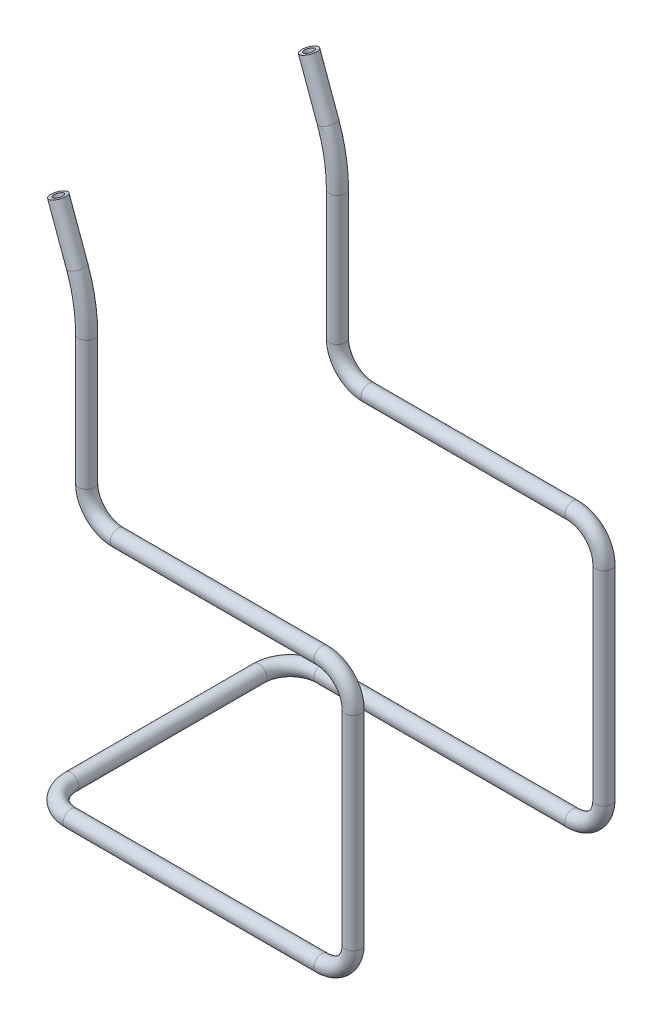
ISO-10303-21;
HEADER;
FILE_DESCRIPTION(('STEP AP214'),'2;1');
FILE_NAME('part.step','',(''),(''),'','','');
FILE_SCHEMA(('AUTOMOTIVE_DESIGN { 1 0 10303 214 1 1 1 1 }'));
ENDSEC;
DATA;
#1=APPLICATION_CONTEXT('core data for automotive mechanical design processes');
#2=APPLICATION_PROTOCOL_DEFINITION('international standard','automotive_design',2000,#1);
#3=PRODUCT_CONTEXT('',#1,'mechanical');
#4=PRODUCT('Part','Part','',(#3));
#5=PRODUCT_RELATED_PRODUCT_CATEGORY('part','',(#4));
#6=PRODUCT_DEFINITION_FORMATION('','',#4);
#7=PRODUCT_DEFINITION_CONTEXT('part definition',#1,'design');
#8=PRODUCT_DEFINITION('design','',#6,#7);
#9=PRODUCT_DEFINITION_SHAPE('','',#8);
#10=(LENGTH_UNIT() NAMED_UNIT(*) SI_UNIT(.MILLI.,.METRE.));
#11=(NAMED_UNIT(*) PLANE_ANGLE_UNIT() SI_UNIT($,.RADIAN.));
#12=(NAMED_UNIT(*) SI_UNIT($,.STERADIAN.) SOLID_ANGLE_UNIT());
#13=UNCERTAINTY_MEASURE_WITH_UNIT(LENGTH_MEASURE(1.E-05),#10,'distance_accuracy_value','');
#14=(GEOMETRIC_REPRESENTATION_CONTEXT(3) GLOBAL_UNCERTAINTY_ASSIGNED_CONTEXT((#13)) GLOBAL_UNIT_ASSIGNED_CONTEXT((#10,
#11,#12)) REPRESENTATION_CONTEXT('',''));
#15=CARTESIAN_POINT('',(0.,0.,0.));
#16=DIRECTION('',(0.,0.,1.));
#17=DIRECTION('',(1.,0.,0.));
#18=AXIS2_PLACEMENT_3D('',#15,#16,#17);
#19=CARTESIAN_POINT('',(5.93646620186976,169.896316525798,40.));
#20=DIRECTION('',(0.342020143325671,-0.939692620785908,0.));
#21=DIRECTION('',(0.939692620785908,0.342020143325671,0.));
#22=AXIS2_PLACEMENT_3D('',#19,#20,#21);
#23=PLANE('',#22);
#24=CARTESIAN_POINT('',(5.93646620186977,169.896316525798,40.));
#25=DIRECTION('',(0.342020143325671,-0.939692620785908,0.));
#26=DIRECTION('',(0.939692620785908,0.342020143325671,0.));
#27=AXIS2_PLACEMENT_3D('',#24,#25,#26);
#28=CIRCLE('',#27,1.5);
#29=CARTESIAN_POINT('',(7.34600513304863,170.409346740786,40.));
#30=VERTEX_POINT('',#29);
#31=EDGE_CURVE('E95',#30,#30,#28,.T.);
#32=ORIENTED_EDGE('',*,*,#31,.T.);
#33=EDGE_LOOP('',(#32));
#34=FACE_BOUND('',#33,.T.);
#35=CARTESIAN_POINT('',(5.93646620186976,169.896316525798,40.));
#36=DIRECTION('',(0.342020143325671,-0.939692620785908,0.));
#37=DIRECTION('',(0.939692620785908,0.342020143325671,0.));
#38=AXIS2_PLACEMENT_3D('',#35,#36,#37);
#39=CIRCLE('',#38,2.5);
#40=CARTESIAN_POINT('',(8.28569775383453,170.751366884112,40.));
#41=VERTEX_POINT('',#40);
#42=EDGE_CURVE('E11',#41,#41,#39,.T.);
#43=ORIENTED_EDGE('',*,*,#42,.F.);
#44=EDGE_LOOP('',(#43));
#45=FACE_BOUND('',#44,.T.);
#46=ADVANCED_FACE('F55',(#34,#45),#23,.F.);
#47=CARTESIAN_POINT('',(0.,0.,0.));
#48=DIRECTION('',(0.,0.,1.));
#49=DIRECTION('',(1.,0.,0.));
#50=AXIS2_PLACEMENT_3D('',#47,#48,#49);
#51=CYLINDRICAL_SURFACE('',#50,2.5);
#52=CARTESIAN_POINT('',(0.,0.,30.));
#53=DIRECTION('',(0.,0.,-1.));
#54=DIRECTION('',(0.,-1.,0.));
#55=AXIS2_PLACEMENT_3D('',#52,#53,#54);
#56=CIRCLE('',#55,2.5);
#57=CARTESIAN_POINT('',(-2.5,0.,30.));
#58=VERTEX_POINT('',#57);
#59=EDGE_CURVE('E92',#58,#58,#56,.T.);
#60=ORIENTED_EDGE('',*,*,#59,.T.);
#61=EDGE_LOOP('',(#60));
#62=FACE_BOUND('',#61,.T.);
#63=CARTESIAN_POINT('',(0.,0.,-30.));
#64=DIRECTION('',(0.,0.,-1.));
#65=DIRECTION('',(0.,-1.,0.));
#66=AXIS2_PLACEMENT_3D('',#63,#64,#65);
#67=CIRCLE('',#66,2.5);
#68=CARTESIAN_POINT('',(-2.5,0.,-30.));
#69=VERTEX_POINT('',#68);
#70=EDGE_CURVE('E158',#69,#69,#67,.F.);
#71=ORIENTED_EDGE('',*,*,#70,.T.);
#72=EDGE_LOOP('',(#71));
#73=FACE_BOUND('',#72,.T.);
#74=ADVANCED_FACE('F305',(#62,#73),#51,.T.);
#75=CARTESIAN_POINT('',(10.,0.,30.));
#76=DIRECTION('',(0.,1.,0.));
#77=DIRECTION('',(0.,0.,1.));
#78=AXIS2_PLACEMENT_3D('',#75,#76,#77);
#79=TOROIDAL_SURFACE('',#78,10.,2.5);
#80=CARTESIAN_POINT('',(10.,0.,40.));
#81=DIRECTION('',(-1.,0.,0.));
#82=DIRECTION('',(0.,-1.,0.));
#83=AXIS2_PLACEMENT_3D('',#80,#81,#82);
#84=CIRCLE('',#83,2.5);
#85=CARTESIAN_POINT('',(10.,0.,42.5));
#86=VERTEX_POINT('',#85);
#87=EDGE_CURVE('E89',#86,#86,#84,.T.);
#88=CARTESIAN_POINT('',(10.,0.,30.));
#89=DIRECTION('',(0.,1.,0.));
#90=DIRECTION('',(0.,0.,1.));
#91=AXIS2_PLACEMENT_3D('',#88,#89,#90);
#92=CIRCLE('',#91,12.5);
#93=EDGE_CURVE('',#58,#86,#92,.T.);
#94=ORIENTED_EDGE('',*,*,#59,.F.);
#95=ORIENTED_EDGE('',*,*,#87,.T.);
#96=ORIENTED_EDGE('',*,*,#93,.T.);
#97=ORIENTED_EDGE('',*,*,#93,.F.);
#98=EDGE_LOOP('',(#94,#96,#95,#97));
#99=FACE_BOUND('',#98,.T.);
#100=ADVANCED_FACE('F307',(#99),#79,.T.);
#101=CARTESIAN_POINT('',(10.,0.,40.));
#102=DIRECTION('',(1.,0.,0.));
#103=DIRECTION('',(0.,0.,-1.));
#104=AXIS2_PLACEMENT_3D('',#101,#102,#103);
#105=CYLINDRICAL_SURFACE('',#104,2.5);
#106=CARTESIAN_POINT('',(90.,0.,40.));
#107=DIRECTION('',(-1.,0.,0.));
#108=DIRECTION('',(0.,-1.,0.));
#109=AXIS2_PLACEMENT_3D('',#106,#107,#108);
#110=CIRCLE('',#109,2.5);
#111=CARTESIAN_POINT('',(90.,-2.5,40.));
#112=VERTEX_POINT('',#111);
#113=EDGE_CURVE('E86',#112,#112,#110,.T.);
#114=ORIENTED_EDGE('',*,*,#113,.T.);
#115=EDGE_LOOP('',(#114));
#116=FACE_BOUND('',#115,.T.);
#117=ORIENTED_EDGE('',*,*,#87,.F.);
#118=EDGE_LOOP('',(#117));
#119=FACE_BOUND('',#118,.T.);
#120=ADVANCED_FACE('F314',(#116,#119),#105,.T.);
#121=CARTESIAN_POINT('',(90.,10.,40.));
#122=DIRECTION('',(0.,0.,1.));
#123=DIRECTION('',(1.,0.,0.));
#124=AXIS2_PLACEMENT_3D('',#121,#122,#123);
#125=TOROIDAL_SURFACE('',#124,10.,2.5);
#126=CARTESIAN_POINT('',(100.,10.,40.));
#127=DIRECTION('',(0.,-1.,0.));
#128=DIRECTION('',(1.,0.,0.));
#129=AXIS2_PLACEMENT_3D('',#126,#127,#128);
#130=CIRCLE('',#129,2.5);
#131=CARTESIAN_POINT('',(102.5,10.,40.));
#132=VERTEX_POINT('',#131);
#133=EDGE_CURVE('E83',#132,#132,#130,.T.);
#134=CARTESIAN_POINT('',(90.,10.,40.));
#135=DIRECTION('',(0.,0.,1.));
#136=DIRECTION('',(1.,0.,0.));
#137=AXIS2_PLACEMENT_3D('',#134,#135,#136);
#138=CIRCLE('',#137,12.5);
#139=EDGE_CURVE('',#112,#132,#138,.T.);
#140=ORIENTED_EDGE('',*,*,#113,.F.);
#141=ORIENTED_EDGE('',*,*,#133,.T.);
#142=ORIENTED_EDGE('',*,*,#139,.T.);
#143=ORIENTED_EDGE('',*,*,#139,.F.);
#144=EDGE_LOOP('',(#140,#142,#141,#143));
#145=FACE_BOUND('',#144,.T.);
#146=ADVANCED_FACE('F322',(#145),#125,.T.);
#147=CARTESIAN_POINT('',(100.,10.,40.));
#148=DIRECTION('',(0.,1.,0.));
#149=DIRECTION('',(0.,0.,1.));
#150=AXIS2_PLACEMENT_3D('',#147,#148,#149);
#151=CYLINDRICAL_SURFACE('',#150,2.5);
#152=CARTESIAN_POINT('',(100.,75.,40.));
#153=DIRECTION('',(0.,-1.,0.));
#154=DIRECTION('',(1.,0.,0.));
#155=AXIS2_PLACEMENT_3D('',#152,#153,#154);
#156=CIRCLE('',#155,2.5);
#157=CARTESIAN_POINT('',(102.5,75.,40.));
#158=VERTEX_POINT('',#157);
#159=EDGE_CURVE('E80',#158,#158,#156,.T.);
#160=ORIENTED_EDGE('',*,*,#159,.T.);
#161=EDGE_LOOP('',(#160));
#162=FACE_BOUND('',#161,.T.);
#163=ORIENTED_EDGE('',*,*,#133,.F.);
#164=EDGE_LOOP('',(#163));
#165=FACE_BOUND('',#164,.T.);
#166=ADVANCED_FACE('F326',(#162,#165),#151,.T.);
#167=CARTESIAN_POINT('',(90.,75.,40.));
#168=DIRECTION('',(0.,0.,1.));
#169=DIRECTION('',(1.,0.,0.));
#170=AXIS2_PLACEMENT_3D('',#167,#168,#169);
#171=TOROIDAL_SURFACE('',#170,9.99999999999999,2.5);
#172=CARTESIAN_POINT('',(90.,85.,40.));
#173=DIRECTION('',(1.,0.,0.));
#174=DIRECTION('',(0.,1.,0.));
#175=AXIS2_PLACEMENT_3D('',#172,#173,#174);
#176=CIRCLE('',#175,2.5);
#177=CARTESIAN_POINT('',(90.,87.5,40.));
#178=VERTEX_POINT('',#177);
#179=EDGE_CURVE('E77',#178,#178,#176,.T.);
#180=CARTESIAN_POINT('',(90.,75.,40.));
#181=DIRECTION('',(0.,0.,1.));
#182=DIRECTION('',(1.,0.,0.));
#183=AXIS2_PLACEMENT_3D('',#180,#181,#182);
#184=CIRCLE('',#183,12.5);
#185=EDGE_CURVE('',#158,#178,#184,.T.);
#186=ORIENTED_EDGE('',*,*,#159,.F.);
#187=ORIENTED_EDGE('',*,*,#179,.T.);
#188=ORIENTED_EDGE('',*,*,#185,.T.);
#189=ORIENTED_EDGE('',*,*,#185,.F.);
#190=EDGE_LOOP('',(#186,#188,#187,#189));
#191=FACE_BOUND('',#190,.T.);
#192=ADVANCED_FACE('F330',(#191),#171,.T.);
#193=CARTESIAN_POINT('',(90.,85.,40.));
#194=DIRECTION('',(-1.,0.,0.));
#195=DIRECTION('',(0.,0.,1.));
#196=AXIS2_PLACEMENT_3D('',#193,#194,#195);
#197=CYLINDRICAL_SURFACE('',#196,2.5);
#198=CARTESIAN_POINT('',(25.,85.,40.));
#199=DIRECTION('',(1.,0.,0.));
#200=DIRECTION('',(0.,1.,0.));
#201=AXIS2_PLACEMENT_3D('',#198,#199,#200);
#202=CIRCLE('',#201,2.5);
#203=CARTESIAN_POINT('',(25.,82.5,40.));
#204=VERTEX_POINT('',#203);
#205=EDGE_CURVE('E74',#204,#204,#202,.T.);
#206=ORIENTED_EDGE('',*,*,#205,.T.);
#207=EDGE_LOOP('',(#206));
#208=FACE_BOUND('',#207,.T.);
#209=ORIENTED_EDGE('',*,*,#179,.F.);
#210=EDGE_LOOP('',(#209));
#211=FACE_BOUND('',#210,.T.);
#212=ADVANCED_FACE('F334',(#208,#211),#197,.T.);
#213=CARTESIAN_POINT('',(25.,95.,40.));
#214=DIRECTION('',(0.,0.,-1.));
#215=DIRECTION('',(-1.,0.,0.));
#216=AXIS2_PLACEMENT_3D('',#213,#214,#215);
#217=TOROIDAL_SURFACE('',#216,9.99999999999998,2.5);
#218=CARTESIAN_POINT('',(15.,95.,40.));
#219=DIRECTION('',(0.,-1.,0.));
#220=DIRECTION('',(1.,0.,0.));
#221=AXIS2_PLACEMENT_3D('',#218,#219,#220);
#222=CIRCLE('',#221,2.5);
#223=CARTESIAN_POINT('',(12.5,95.,40.));
#224=VERTEX_POINT('',#223);
#225=EDGE_CURVE('E69',#224,#224,#222,.T.);
#226=CARTESIAN_POINT('',(25.,95.,40.));
#227=DIRECTION('',(0.,0.,-1.));
#228=DIRECTION('',(-1.,0.,0.));
#229=AXIS2_PLACEMENT_3D('',#226,#227,#228);
#230=CIRCLE('',#229,12.5);
#231=EDGE_CURVE('',#204,#224,#230,.T.);
#232=ORIENTED_EDGE('',*,*,#205,.F.);
#233=ORIENTED_EDGE('',*,*,#225,.T.);
#234=ORIENTED_EDGE('',*,*,#231,.T.);
#235=ORIENTED_EDGE('',*,*,#231,.F.);
#236=EDGE_LOOP('',(#232,#234,#233,#235));
#237=FACE_BOUND('',#236,.T.);
#238=ADVANCED_FACE('F338',(#237),#217,.T.);
#239=CARTESIAN_POINT('',(15.,95.,40.));
#240=DIRECTION('',(0.,1.,0.));
#241=DIRECTION('',(-1.,0.,0.));
#242=AXIS2_PLACEMENT_3D('',#239,#240,#241);
#243=CYLINDRICAL_SURFACE('',#242,2.5);
#244=CARTESIAN_POINT('',(15.,136.178113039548,40.));
#245=DIRECTION('',(0.,-1.,0.));
#246=DIRECTION('',(1.,0.,0.));
#247=AXIS2_PLACEMENT_3D('',#244,#245,#246);
#248=CIRCLE('',#247,2.5);
#249=CARTESIAN_POINT('',(17.5,136.178113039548,40.));
#250=VERTEX_POINT('',#249);
#251=EDGE_CURVE('E65',#250,#250,#248,.T.);
#252=ORIENTED_EDGE('',*,*,#251,.T.);
#253=EDGE_LOOP('',(#252));
#254=FACE_BOUND('',#253,.T.);
#255=ORIENTED_EDGE('',*,*,#225,.F.);
#256=EDGE_LOOP('',(#255));
#257=FACE_BOUND('',#256,.T.);
#258=ADVANCED_FACE('F342',(#254,#257),#243,.T.);
#259=CARTESIAN_POINT('',(-35.,136.178113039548,40.));
#260=DIRECTION('',(0.,0.,1.));
#261=DIRECTION('',(1.,0.,0.));
#262=AXIS2_PLACEMENT_3D('',#259,#260,#261);
#263=TOROIDAL_SURFACE('',#262,50.,2.5);
#264=CARTESIAN_POINT('',(11.9846310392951,153.279120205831,40.));
#265=DIRECTION('',(0.342020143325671,-0.939692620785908,0.));
#266=DIRECTION('',(0.939692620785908,0.342020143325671,0.));
#267=AXIS2_PLACEMENT_3D('',#264,#265,#266);
#268=CIRCLE('',#267,2.5);
#269=CARTESIAN_POINT('',(14.3338625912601,154.134170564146,40.));
#270=VERTEX_POINT('',#269);
#271=EDGE_CURVE('E61',#270,#270,#268,.T.);
#272=CARTESIAN_POINT('',(-35.,136.178113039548,40.));
#273=DIRECTION('',(0.,0.,1.));
#274=DIRECTION('',(1.,0.,0.));
#275=AXIS2_PLACEMENT_3D('',#272,#273,#274);
#276=CIRCLE('',#275,52.5);
#277=EDGE_CURVE('',#250,#270,#276,.T.);
#278=ORIENTED_EDGE('',*,*,#251,.F.);
#279=ORIENTED_EDGE('',*,*,#271,.T.);
#280=ORIENTED_EDGE('',*,*,#277,.T.);
#281=ORIENTED_EDGE('',*,*,#277,.F.);
#282=EDGE_LOOP('',(#278,#280,#279,#281));
#283=FACE_BOUND('',#282,.T.);
#284=ADVANCED_FACE('F211',(#283),#263,.T.);
#285=CARTESIAN_POINT('',(11.9846310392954,153.279120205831,40.));
#286=DIRECTION('',(-0.34202014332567,0.939692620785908,0.));
#287=DIRECTION('',(-0.939692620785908,-0.34202014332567,0.));
#288=AXIS2_PLACEMENT_3D('',#285,#286,#287);
#289=CYLINDRICAL_SURFACE('',#288,2.5);
#290=ORIENTED_EDGE('',*,*,#42,.T.);
#291=EDGE_LOOP('',(#290));
#292=FACE_BOUND('',#291,.T.);
#293=ORIENTED_EDGE('',*,*,#271,.F.);
#294=EDGE_LOOP('',(#293));
#295=FACE_BOUND('',#294,.T.);
#296=ADVANCED_FACE('F200',(#292,#295),#289,.T.);
#297=CARTESIAN_POINT('',(0.,0.,0.));
#298=DIRECTION('',(0.,0.,1.));
#299=DIRECTION('',(1.,0.,0.));
#300=AXIS2_PLACEMENT_3D('',#297,#298,#299);
#301=CYLINDRICAL_SURFACE('',#300,1.5);
#302=CARTESIAN_POINT('',(0.,0.,30.));
#303=DIRECTION('',(0.,0.,1.));
#304=DIRECTION('',(1.,0.,0.));
#305=AXIS2_PLACEMENT_3D('',#302,#303,#304);
#306=CIRCLE('',#305,1.5);
#307=CARTESIAN_POINT('',(-1.5,0.,30.));
#308=VERTEX_POINT('',#307);
#309=EDGE_CURVE('E125',#308,#308,#306,.F.);
#310=ORIENTED_EDGE('',*,*,#309,.F.);
#311=EDGE_LOOP('',(#310));
#312=FACE_BOUND('',#311,.T.);
#313=CARTESIAN_POINT('',(0.,0.,-30.));
#314=DIRECTION('',(0.,0.,-1.));
#315=DIRECTION('',(-1.,0.,0.));
#316=AXIS2_PLACEMENT_3D('',#313,#314,#315);
#317=CIRCLE('',#316,1.5);
#318=CARTESIAN_POINT('',(-1.5,0.,-30.));
#319=VERTEX_POINT('',#318);
#320=EDGE_CURVE('E191',#319,#319,#317,.F.);
#321=ORIENTED_EDGE('',*,*,#320,.F.);
#322=EDGE_LOOP('',(#321));
#323=FACE_BOUND('',#322,.T.);
#324=ADVANCED_FACE('F197',(#312,#323),#301,.F.);
#325=CARTESIAN_POINT('',(10.,0.,30.));
#326=DIRECTION('',(0.,1.,0.));
#327=DIRECTION('',(0.,0.,1.));
#328=AXIS2_PLACEMENT_3D('',#325,#326,#327);
#329=TOROIDAL_SURFACE('',#328,10.,1.5);
#330=CARTESIAN_POINT('',(10.,0.,40.));
#331=DIRECTION('',(-1.,0.,0.));
#332=DIRECTION('',(0.,0.,1.));
#333=AXIS2_PLACEMENT_3D('',#330,#331,#332);
#334=CIRCLE('',#333,1.5);
#335=CARTESIAN_POINT('',(10.,0.,41.5));
#336=VERTEX_POINT('',#335);
#337=EDGE_CURVE('E122',#336,#336,#334,.T.);
#338=CARTESIAN_POINT('',(10.,0.,30.));
#339=DIRECTION('',(0.,1.,0.));
#340=DIRECTION('',(0.,0.,1.));
#341=AXIS2_PLACEMENT_3D('',#338,#339,#340);
#342=CIRCLE('',#341,11.5);
#343=EDGE_CURVE('',#308,#336,#342,.T.);
#344=ORIENTED_EDGE('',*,*,#309,.T.);
#345=ORIENTED_EDGE('',*,*,#337,.F.);
#346=ORIENTED_EDGE('',*,*,#343,.T.);
#347=ORIENTED_EDGE('',*,*,#343,.F.);
#348=EDGE_LOOP('',(#344,#346,#345,#347));
#349=FACE_BOUND('',#348,.T.);
#350=ADVANCED_FACE('F199',(#349),#329,.F.);
#351=CARTESIAN_POINT('',(10.,0.,40.));
#352=DIRECTION('',(1.,0.,0.));
#353=DIRECTION('',(0.,0.,-1.));
#354=AXIS2_PLACEMENT_3D('',#351,#352,#353);
#355=CYLINDRICAL_SURFACE('',#354,1.5);
#356=CARTESIAN_POINT('',(90.,0.,40.));
#357=DIRECTION('',(1.,0.,0.));
#358=DIRECTION('',(0.,0.,-1.));
#359=AXIS2_PLACEMENT_3D('',#356,#357,#358);
#360=CIRCLE('',#359,1.5);
#361=CARTESIAN_POINT('',(90.,-1.5,40.));
#362=VERTEX_POINT('',#361);
#363=EDGE_CURVE('E119',#362,#362,#360,.F.);
#364=ORIENTED_EDGE('',*,*,#363,.F.);
#365=EDGE_LOOP('',(#364));
#366=FACE_BOUND('',#365,.T.);
#367=ORIENTED_EDGE('',*,*,#337,.T.);
#368=EDGE_LOOP('',(#367));
#369=FACE_BOUND('',#368,.T.);
#370=ADVANCED_FACE('F208',(#366,#369),#355,.F.);
#371=CARTESIAN_POINT('',(90.,10.,40.));
#372=DIRECTION('',(0.,0.,1.));
#373=DIRECTION('',(1.,0.,0.));
#374=AXIS2_PLACEMENT_3D('',#371,#372,#373);
#375=TOROIDAL_SURFACE('',#374,10.,1.5);
#376=CARTESIAN_POINT('',(100.,10.,40.));
#377=DIRECTION('',(0.,-1.,0.));
#378=DIRECTION('',(1.,0.,0.));
#379=AXIS2_PLACEMENT_3D('',#376,#377,#378);
#380=CIRCLE('',#379,1.5);
#381=CARTESIAN_POINT('',(101.5,10.0000000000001,40.));
#382=VERTEX_POINT('',#381);
#383=EDGE_CURVE('E116',#382,#382,#380,.T.);
#384=CARTESIAN_POINT('',(90.,10.,40.));
#385=DIRECTION('',(0.,0.,1.));
#386=DIRECTION('',(1.,0.,0.));
#387=AXIS2_PLACEMENT_3D('',#384,#385,#386);
#388=CIRCLE('',#387,11.5);
#389=EDGE_CURVE('',#362,#382,#388,.T.);
#390=ORIENTED_EDGE('',*,*,#363,.T.);
#391=ORIENTED_EDGE('',*,*,#383,.F.);
#392=ORIENTED_EDGE('',*,*,#389,.T.);
#393=ORIENTED_EDGE('',*,*,#389,.F.);
#394=EDGE_LOOP('',(#390,#392,#391,#393));
#395=FACE_BOUND('',#394,.T.);
#396=ADVANCED_FACE('F390',(#395),#375,.F.);
#397=CARTESIAN_POINT('',(100.,10.,40.));
#398=DIRECTION('',(0.,1.,0.));
#399=DIRECTION('',(0.,0.,1.));
#400=AXIS2_PLACEMENT_3D('',#397,#398,#399);
#401=CYLINDRICAL_SURFACE('',#400,1.5);
#402=CARTESIAN_POINT('',(100.,75.,40.));
#403=DIRECTION('',(0.,1.,0.));
#404=DIRECTION('',(0.,0.,1.));
#405=AXIS2_PLACEMENT_3D('',#402,#403,#404);
#406=CIRCLE('',#405,1.5);
#407=CARTESIAN_POINT('',(101.5,75.,40.));
#408=VERTEX_POINT('',#407);
#409=EDGE_CURVE('E113',#408,#408,#406,.F.);
#410=ORIENTED_EDGE('',*,*,#409,.F.);
#411=EDGE_LOOP('',(#410));
#412=FACE_BOUND('',#411,.T.);
#413=ORIENTED_EDGE('',*,*,#383,.T.);
#414=EDGE_LOOP('',(#413));
#415=FACE_BOUND('',#414,.T.);
#416=ADVANCED_FACE('F400',(#412,#415),#401,.F.);
#417=CARTESIAN_POINT('',(90.,75.,40.));
#418=DIRECTION('',(0.,0.,1.));
#419=DIRECTION('',(1.,0.,0.));
#420=AXIS2_PLACEMENT_3D('',#417,#418,#419);
#421=TOROIDAL_SURFACE('',#420,9.99999999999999,1.5);
#422=CARTESIAN_POINT('',(90.,85.,40.));
#423=DIRECTION('',(1.,0.,0.));
#424=DIRECTION('',(0.,1.,0.));
#425=AXIS2_PLACEMENT_3D('',#422,#423,#424);
#426=CIRCLE('',#425,1.5);
#427=CARTESIAN_POINT('',(90.,86.5,40.));
#428=VERTEX_POINT('',#427);
#429=EDGE_CURVE('E110',#428,#428,#426,.T.);
#430=CARTESIAN_POINT('',(90.,75.,40.));
#431=DIRECTION('',(0.,0.,1.));
#432=DIRECTION('',(1.,0.,0.));
#433=AXIS2_PLACEMENT_3D('',#430,#431,#432);
#434=CIRCLE('',#433,11.5);
#435=EDGE_CURVE('',#408,#428,#434,.T.);
#436=ORIENTED_EDGE('',*,*,#409,.T.);
#437=ORIENTED_EDGE('',*,*,#429,.F.);
#438=ORIENTED_EDGE('',*,*,#435,.T.);
#439=ORIENTED_EDGE('',*,*,#435,.F.);
#440=EDGE_LOOP('',(#436,#438,#437,#439));
#441=FACE_BOUND('',#440,.T.);
#442=ADVANCED_FACE('F410',(#441),#421,.F.);
#443=CARTESIAN_POINT('',(90.,85.,40.));
#444=DIRECTION('',(-1.,0.,0.));
#445=DIRECTION('',(0.,0.,1.));
#446=AXIS2_PLACEMENT_3D('',#443,#444,#445);
#447=CYLINDRICAL_SURFACE('',#446,1.5);
#448=CARTESIAN_POINT('',(25.,85.,40.));
#449=DIRECTION('',(-1.,0.,0.));
#450=DIRECTION('',(0.,0.,1.));
#451=AXIS2_PLACEMENT_3D('',#448,#449,#450);
#452=CIRCLE('',#451,1.5);
#453=CARTESIAN_POINT('',(25.,83.5,40.));
#454=VERTEX_POINT('',#453);
#455=EDGE_CURVE('E107',#454,#454,#452,.F.);
#456=ORIENTED_EDGE('',*,*,#455,.F.);
#457=EDGE_LOOP('',(#456));
#458=FACE_BOUND('',#457,.T.);
#459=ORIENTED_EDGE('',*,*,#429,.T.);
#460=EDGE_LOOP('',(#459));
#461=FACE_BOUND('',#460,.T.);
#462=ADVANCED_FACE('F420',(#458,#461),#447,.F.);
#463=CARTESIAN_POINT('',(25.,95.,40.));
#464=DIRECTION('',(0.,0.,-1.));
#465=DIRECTION('',(-1.,0.,0.));
#466=AXIS2_PLACEMENT_3D('',#463,#464,#465);
#467=TOROIDAL_SURFACE('',#466,9.99999999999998,1.5);
#468=CARTESIAN_POINT('',(15.,95.,40.));
#469=DIRECTION('',(0.,-1.,0.));
#470=DIRECTION('',(1.,0.,0.));
#471=AXIS2_PLACEMENT_3D('',#468,#469,#470);
#472=CIRCLE('',#471,1.5);
#473=CARTESIAN_POINT('',(13.5,95.,40.));
#474=VERTEX_POINT('',#473);
#475=EDGE_CURVE('E104',#474,#474,#472,.T.);
#476=CARTESIAN_POINT('',(25.,95.,40.));
#477=DIRECTION('',(0.,0.,-1.));
#478=DIRECTION('',(-1.,0.,0.));
#479=AXIS2_PLACEMENT_3D('',#476,#477,#478);
#480=CIRCLE('',#479,11.5);
#481=EDGE_CURVE('',#454,#474,#480,.T.);
#482=ORIENTED_EDGE('',*,*,#455,.T.);
#483=ORIENTED_EDGE('',*,*,#475,.F.);
#484=ORIENTED_EDGE('',*,*,#481,.T.);
#485=ORIENTED_EDGE('',*,*,#481,.F.);
#486=EDGE_LOOP('',(#482,#484,#483,#485));
#487=FACE_BOUND('',#486,.T.);
#488=ADVANCED_FACE('F430',(#487),#467,.F.);
#489=CARTESIAN_POINT('',(15.,95.,40.));
#490=DIRECTION('',(0.,1.,0.));
#491=DIRECTION('',(-1.,0.,0.));
#492=AXIS2_PLACEMENT_3D('',#489,#490,#491);
#493=CYLINDRICAL_SURFACE('',#492,1.5);
#494=CARTESIAN_POINT('',(15.,136.178113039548,40.));
#495=DIRECTION('',(0.,1.,0.));
#496=DIRECTION('',(-1.,0.,0.));
#497=AXIS2_PLACEMENT_3D('',#494,#495,#496);
#498=CIRCLE('',#497,1.5);
#499=CARTESIAN_POINT('',(16.5,136.178113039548,40.));
#500=VERTEX_POINT('',#499);
#501=EDGE_CURVE('E101',#500,#500,#498,.F.);
#502=ORIENTED_EDGE('',*,*,#501,.F.);
#503=EDGE_LOOP('',(#502));
#504=FACE_BOUND('',#503,.T.);
#505=ORIENTED_EDGE('',*,*,#475,.T.);
#506=EDGE_LOOP('',(#505));
#507=FACE_BOUND('',#506,.T.);
#508=ADVANCED_FACE('F440',(#504,#507),#493,.F.);
#509=CARTESIAN_POINT('',(-35.,136.178113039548,40.));
#510=DIRECTION('',(0.,0.,1.));
#511=DIRECTION('',(1.,0.,0.));
#512=AXIS2_PLACEMENT_3D('',#509,#510,#511);
#513=TOROIDAL_SURFACE('',#512,50.,1.5);
#514=CARTESIAN_POINT('',(11.9846310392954,153.279120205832,40.));
#515=DIRECTION('',(0.342020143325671,-0.939692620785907,0.));
#516=DIRECTION('',(0.939692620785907,0.342020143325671,0.));
#517=AXIS2_PLACEMENT_3D('',#514,#515,#516);
#518=CIRCLE('',#517,1.5);
#519=CARTESIAN_POINT('',(13.3941699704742,153.79215042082,40.));
#520=VERTEX_POINT('',#519);
#521=EDGE_CURVE('E98',#520,#520,#518,.T.);
#522=CARTESIAN_POINT('',(-35.,136.178113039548,40.));
#523=DIRECTION('',(0.,0.,1.));
#524=DIRECTION('',(1.,0.,0.));
#525=AXIS2_PLACEMENT_3D('',#522,#523,#524);
#526=CIRCLE('',#525,51.5);
#527=EDGE_CURVE('',#500,#520,#526,.T.);
#528=ORIENTED_EDGE('',*,*,#501,.T.);
#529=ORIENTED_EDGE('',*,*,#521,.F.);
#530=ORIENTED_EDGE('',*,*,#527,.T.);
#531=ORIENTED_EDGE('',*,*,#527,.F.);
#532=EDGE_LOOP('',(#528,#530,#529,#531));
#533=FACE_BOUND('',#532,.T.);
#534=ADVANCED_FACE('F243',(#533),#513,.F.);
#535=CARTESIAN_POINT('',(11.9846310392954,153.279120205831,40.));
#536=DIRECTION('',(-0.34202014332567,0.939692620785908,0.));
#537=DIRECTION('',(-0.939692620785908,-0.34202014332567,0.));
#538=AXIS2_PLACEMENT_3D('',#535,#536,#537);
#539=CYLINDRICAL_SURFACE('',#538,1.5);
#540=ORIENTED_EDGE('',*,*,#31,.F.);
#541=EDGE_LOOP('',(#540));
#542=FACE_BOUND('',#541,.T.);
#543=ORIENTED_EDGE('',*,*,#521,.T.);
#544=EDGE_LOOP('',(#543));
#545=FACE_BOUND('',#544,.T.);
#546=ADVANCED_FACE('F233',(#542,#545),#539,.F.);
#547=CARTESIAN_POINT('',(5.93646620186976,169.896316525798,-40.));
#548=DIRECTION('',(0.342020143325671,-0.939692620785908,0.));
#549=DIRECTION('',(0.939692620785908,0.342020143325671,0.));
#550=AXIS2_PLACEMENT_3D('',#547,#548,#549);
#551=PLANE('',#550);
#552=CARTESIAN_POINT('',(5.93646620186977,169.896316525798,-40.));
#553=DIRECTION('',(0.342020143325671,-0.939692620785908,0.));
#554=DIRECTION('',(0.939692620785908,0.342020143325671,0.));
#555=AXIS2_PLACEMENT_3D('',#552,#553,#554);
#556=CIRCLE('',#555,1.5);
#557=CARTESIAN_POINT('',(7.34600513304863,170.409346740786,-40.));
#558=VERTEX_POINT('',#557);
#559=EDGE_CURVE('E161',#558,#558,#556,.T.);
#560=ORIENTED_EDGE('',*,*,#559,.T.);
#561=EDGE_LOOP('',(#560));
#562=FACE_BOUND('',#561,.T.);
#563=CARTESIAN_POINT('',(5.93646620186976,169.896316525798,-40.));
#564=DIRECTION('',(-0.342020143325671,0.939692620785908,0.));
#565=DIRECTION('',(0.939692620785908,0.342020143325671,0.));
#566=AXIS2_PLACEMENT_3D('',#563,#564,#565);
#567=CIRCLE('',#566,2.5);
#568=CARTESIAN_POINT('',(8.28569775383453,170.751366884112,-40.));
#569=VERTEX_POINT('',#568);
#570=EDGE_CURVE('E128',#569,#569,#567,.F.);
#571=ORIENTED_EDGE('',*,*,#570,.F.);
#572=EDGE_LOOP('',(#571));
#573=FACE_BOUND('',#572,.T.);
#574=ADVANCED_FACE('F230',(#562,#573),#551,.F.);
#575=CARTESIAN_POINT('',(10.,0.,-30.));
#576=DIRECTION('',(0.,-1.,0.));
#577=DIRECTION('',(0.,0.,-1.));
#578=AXIS2_PLACEMENT_3D('',#575,#576,#577);
#579=TOROIDAL_SURFACE('',#578,10.,2.5);
#580=CARTESIAN_POINT('',(10.,0.,-40.));
#581=DIRECTION('',(1.,0.,0.));
#582=DIRECTION('',(0.,-1.,0.));
#583=AXIS2_PLACEMENT_3D('',#580,#581,#582);
#584=CIRCLE('',#583,2.5);
#585=CARTESIAN_POINT('',(10.,0.,-42.5));
#586=VERTEX_POINT('',#585);
#587=EDGE_CURVE('E155',#586,#586,#584,.F.);
#588=CARTESIAN_POINT('',(10.,0.,-30.));
#589=DIRECTION('',(0.,-1.,0.));
#590=DIRECTION('',(0.,0.,-1.));
#591=AXIS2_PLACEMENT_3D('',#588,#589,#590);
#592=CIRCLE('',#591,12.5);
#593=EDGE_CURVE('',#69,#586,#592,.T.);
#594=ORIENTED_EDGE('',*,*,#70,.F.);
#595=ORIENTED_EDGE('',*,*,#587,.T.);
#596=ORIENTED_EDGE('',*,*,#593,.T.);
#597=ORIENTED_EDGE('',*,*,#593,.F.);
#598=EDGE_LOOP('',(#594,#596,#595,#597));
#599=FACE_BOUND('',#598,.T.);
#600=ADVANCED_FACE('F232',(#599),#579,.T.);
#601=CARTESIAN_POINT('',(10.,0.,-40.));
#602=DIRECTION('',(1.,0.,0.));
#603=DIRECTION('',(0.,0.,-1.));
#604=AXIS2_PLACEMENT_3D('',#601,#602,#603);
#605=CYLINDRICAL_SURFACE('',#604,2.5);
#606=CARTESIAN_POINT('',(90.,0.,-40.));
#607=DIRECTION('',(1.,0.,0.));
#608=DIRECTION('',(0.,-1.,0.));
#609=AXIS2_PLACEMENT_3D('',#606,#607,#608);
#610=CIRCLE('',#609,2.5);
#611=CARTESIAN_POINT('',(90.,-2.5,-40.));
#612=VERTEX_POINT('',#611);
#613=EDGE_CURVE('E152',#612,#612,#610,.F.);
#614=ORIENTED_EDGE('',*,*,#613,.T.);
#615=EDGE_LOOP('',(#614));
#616=FACE_BOUND('',#615,.T.);
#617=ORIENTED_EDGE('',*,*,#587,.F.);
#618=EDGE_LOOP('',(#617));
#619=FACE_BOUND('',#618,.T.);
#620=ADVANCED_FACE('F240',(#616,#619),#605,.T.);
#621=CARTESIAN_POINT('',(90.,10.,-40.));
#622=DIRECTION('',(0.,0.,1.));
#623=DIRECTION('',(1.,0.,0.));
#624=AXIS2_PLACEMENT_3D('',#621,#622,#623);
#625=TOROIDAL_SURFACE('',#624,10.,2.5);
#626=CARTESIAN_POINT('',(100.,10.,-40.));
#627=DIRECTION('',(0.,1.,0.));
#628=DIRECTION('',(1.,0.,0.));
#629=AXIS2_PLACEMENT_3D('',#626,#627,#628);
#630=CIRCLE('',#629,2.5);
#631=CARTESIAN_POINT('',(102.5,10.,-40.));
#632=VERTEX_POINT('',#631);
#633=EDGE_CURVE('E149',#632,#632,#630,.F.);
#634=CARTESIAN_POINT('',(90.,10.,-40.));
#635=DIRECTION('',(0.,0.,1.));
#636=DIRECTION('',(1.,0.,0.));
#637=AXIS2_PLACEMENT_3D('',#634,#635,#636);
#638=CIRCLE('',#637,12.5);
#639=EDGE_CURVE('',#612,#632,#638,.T.);
#640=ORIENTED_EDGE('',*,*,#613,.F.);
#641=ORIENTED_EDGE('',*,*,#633,.T.);
#642=ORIENTED_EDGE('',*,*,#639,.T.);
#643=ORIENTED_EDGE('',*,*,#639,.F.);
#644=EDGE_LOOP('',(#640,#642,#641,#643));
#645=FACE_BOUND('',#644,.T.);
#646=ADVANCED_FACE('F263',(#645),#625,.T.);
#647=CARTESIAN_POINT('',(100.,10.,-40.));
#648=DIRECTION('',(0.,1.,0.));
#649=DIRECTION('',(0.,0.,1.));
#650=AXIS2_PLACEMENT_3D('',#647,#648,#649);
#651=CYLINDRICAL_SURFACE('',#650,2.5);
#652=CARTESIAN_POINT('',(100.,75.,-40.));
#653=DIRECTION('',(0.,1.,0.));
#654=DIRECTION('',(1.,0.,0.));
#655=AXIS2_PLACEMENT_3D('',#652,#653,#654);
#656=CIRCLE('',#655,2.5);
#657=CARTESIAN_POINT('',(102.5,75.,-40.));
#658=VERTEX_POINT('',#657);
#659=EDGE_CURVE('E146',#658,#658,#656,.F.);
#660=ORIENTED_EDGE('',*,*,#659,.T.);
#661=EDGE_LOOP('',(#660));
#662=FACE_BOUND('',#661,.T.);
#663=ORIENTED_EDGE('',*,*,#633,.F.);
#664=EDGE_LOOP('',(#663));
#665=FACE_BOUND('',#664,.T.);
#666=ADVANCED_FACE('F267',(#662,#665),#651,.T.);
#667=CARTESIAN_POINT('',(90.,75.,-40.));
#668=DIRECTION('',(0.,0.,1.));
#669=DIRECTION('',(1.,0.,0.));
#670=AXIS2_PLACEMENT_3D('',#667,#668,#669);
#671=TOROIDAL_SURFACE('',#670,9.99999999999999,2.5);
#672=CARTESIAN_POINT('',(90.,85.,-40.));
#673=DIRECTION('',(-1.,0.,0.));
#674=DIRECTION('',(0.,1.,0.));
#675=AXIS2_PLACEMENT_3D('',#672,#673,#674);
#676=CIRCLE('',#675,2.5);
#677=CARTESIAN_POINT('',(90.,87.5,-40.));
#678=VERTEX_POINT('',#677);
#679=EDGE_CURVE('E143',#678,#678,#676,.F.);
#680=CARTESIAN_POINT('',(90.,75.,-40.));
#681=DIRECTION('',(0.,0.,1.));
#682=DIRECTION('',(1.,0.,0.));
#683=AXIS2_PLACEMENT_3D('',#680,#681,#682);
#684=CIRCLE('',#683,12.5);
#685=EDGE_CURVE('',#658,#678,#684,.T.);
#686=ORIENTED_EDGE('',*,*,#659,.F.);
#687=ORIENTED_EDGE('',*,*,#679,.T.);
#688=ORIENTED_EDGE('',*,*,#685,.T.);
#689=ORIENTED_EDGE('',*,*,#685,.F.);
#690=EDGE_LOOP('',(#686,#688,#687,#689));
#691=FACE_BOUND('',#690,.T.);
#692=ADVANCED_FACE('F271',(#691),#671,.T.);
#693=CARTESIAN_POINT('',(90.,85.,-40.));
#694=DIRECTION('',(-1.,0.,0.));
#695=DIRECTION('',(0.,0.,1.));
#696=AXIS2_PLACEMENT_3D('',#693,#694,#695);
#697=CYLINDRICAL_SURFACE('',#696,2.5);
#698=CARTESIAN_POINT('',(25.,85.,-40.));
#699=DIRECTION('',(-1.,0.,0.));
#700=DIRECTION('',(0.,1.,0.));
#701=AXIS2_PLACEMENT_3D('',#698,#699,#700);
#702=CIRCLE('',#701,2.5);
#703=CARTESIAN_POINT('',(25.,82.5,-40.));
#704=VERTEX_POINT('',#703);
#705=EDGE_CURVE('E140',#704,#704,#702,.F.);
#706=ORIENTED_EDGE('',*,*,#705,.T.);
#707=EDGE_LOOP('',(#706));
#708=FACE_BOUND('',#707,.T.);
#709=ORIENTED_EDGE('',*,*,#679,.F.);
#710=EDGE_LOOP('',(#709));
#711=FACE_BOUND('',#710,.T.);
#712=ADVANCED_FACE('F275',(#708,#711),#697,.T.);
#713=CARTESIAN_POINT('',(25.,95.,-40.));
#714=DIRECTION('',(0.,0.,-1.));
#715=DIRECTION('',(-1.,0.,0.));
#716=AXIS2_PLACEMENT_3D('',#713,#714,#715);
#717=TOROIDAL_SURFACE('',#716,9.99999999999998,2.5);
#718=CARTESIAN_POINT('',(15.,95.,-40.));
#719=DIRECTION('',(0.,1.,0.));
#720=DIRECTION('',(1.,0.,0.));
#721=AXIS2_PLACEMENT_3D('',#718,#719,#720);
#722=CIRCLE('',#721,2.5);
#723=CARTESIAN_POINT('',(12.5,95.,-40.));
#724=VERTEX_POINT('',#723);
#725=EDGE_CURVE('E137',#724,#724,#722,.F.);
#726=CARTESIAN_POINT('',(25.,95.,-40.));
#727=DIRECTION('',(0.,0.,-1.));
#728=DIRECTION('',(-1.,0.,0.));
#729=AXIS2_PLACEMENT_3D('',#726,#727,#728);
#730=CIRCLE('',#729,12.5);
#731=EDGE_CURVE('',#704,#724,#730,.T.);
#732=ORIENTED_EDGE('',*,*,#705,.F.);
#733=ORIENTED_EDGE('',*,*,#725,.T.);
#734=ORIENTED_EDGE('',*,*,#731,.T.);
#735=ORIENTED_EDGE('',*,*,#731,.F.);
#736=EDGE_LOOP('',(#732,#734,#733,#735));
#737=FACE_BOUND('',#736,.T.);
#738=ADVANCED_FACE('F279',(#737),#717,.T.);
#739=CARTESIAN_POINT('',(15.,95.,-40.));
#740=DIRECTION('',(0.,1.,0.));
#741=DIRECTION('',(-1.,0.,0.));
#742=AXIS2_PLACEMENT_3D('',#739,#740,#741);
#743=CYLINDRICAL_SURFACE('',#742,2.5);
#744=CARTESIAN_POINT('',(15.,136.178113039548,-40.));
#745=DIRECTION('',(0.,1.,0.));
#746=DIRECTION('',(1.,0.,0.));
#747=AXIS2_PLACEMENT_3D('',#744,#745,#746);
#748=CIRCLE('',#747,2.5);
#749=CARTESIAN_POINT('',(17.5,136.178113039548,-40.));
#750=VERTEX_POINT('',#749);
#751=EDGE_CURVE('E134',#750,#750,#748,.F.);
#752=ORIENTED_EDGE('',*,*,#751,.T.);
#753=EDGE_LOOP('',(#752));
#754=FACE_BOUND('',#753,.T.);
#755=ORIENTED_EDGE('',*,*,#725,.F.);
#756=EDGE_LOOP('',(#755));
#757=FACE_BOUND('',#756,.T.);
#758=ADVANCED_FACE('F225',(#754,#757),#743,.T.);
#759=CARTESIAN_POINT('',(-35.,136.178113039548,-40.));
#760=DIRECTION('',(0.,0.,1.));
#761=DIRECTION('',(1.,0.,0.));
#762=AXIS2_PLACEMENT_3D('',#759,#760,#761);
#763=TOROIDAL_SURFACE('',#762,50.,2.5);
#764=CARTESIAN_POINT('',(11.9846310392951,153.279120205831,-40.));
#765=DIRECTION('',(-0.342020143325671,0.939692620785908,0.));
#766=DIRECTION('',(0.939692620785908,0.342020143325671,0.));
#767=AXIS2_PLACEMENT_3D('',#764,#765,#766);
#768=CIRCLE('',#767,2.5);
#769=CARTESIAN_POINT('',(14.3338625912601,154.134170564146,-40.));
#770=VERTEX_POINT('',#769);
#771=EDGE_CURVE('E131',#770,#770,#768,.F.);
#772=CARTESIAN_POINT('',(-35.,136.178113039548,-40.));
#773=DIRECTION('',(0.,0.,1.));
#774=DIRECTION('',(1.,0.,0.));
#775=AXIS2_PLACEMENT_3D('',#772,#773,#774);
#776=CIRCLE('',#775,52.5);
#777=EDGE_CURVE('',#750,#770,#776,.T.);
#778=ORIENTED_EDGE('',*,*,#751,.F.);
#779=ORIENTED_EDGE('',*,*,#771,.T.);
#780=ORIENTED_EDGE('',*,*,#777,.T.);
#781=ORIENTED_EDGE('',*,*,#777,.F.);
#782=EDGE_LOOP('',(#778,#780,#779,#781));
#783=FACE_BOUND('',#782,.T.);
#784=ADVANCED_FACE('F215',(#783),#763,.T.);
#785=CARTESIAN_POINT('',(11.9846310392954,153.279120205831,-40.));
#786=DIRECTION('',(-0.34202014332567,0.939692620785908,0.));
#787=DIRECTION('',(-0.939692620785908,-0.34202014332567,0.));
#788=AXIS2_PLACEMENT_3D('',#785,#786,#787);
#789=CYLINDRICAL_SURFACE('',#788,2.5);
#790=ORIENTED_EDGE('',*,*,#570,.T.);
#791=EDGE_LOOP('',(#790));
#792=FACE_BOUND('',#791,.T.);
#793=ORIENTED_EDGE('',*,*,#771,.F.);
#794=EDGE_LOOP('',(#793));
#795=FACE_BOUND('',#794,.T.);
#796=ADVANCED_FACE('F203',(#792,#795),#789,.T.);
#797=CARTESIAN_POINT('',(10.,0.,-30.));
#798=DIRECTION('',(0.,-1.,0.));
#799=DIRECTION('',(0.,0.,-1.));
#800=AXIS2_PLACEMENT_3D('',#797,#798,#799);
#801=TOROIDAL_SURFACE('',#800,10.,1.5);
#802=CARTESIAN_POINT('',(10.,0.,-40.));
#803=DIRECTION('',(-1.,0.,0.));
#804=DIRECTION('',(0.,0.,1.));
#805=AXIS2_PLACEMENT_3D('',#802,#803,#804);
#806=CIRCLE('',#805,1.5);
#807=CARTESIAN_POINT('',(10.,0.,-41.5));
#808=VERTEX_POINT('',#807);
#809=EDGE_CURVE('E188',#808,#808,#806,.T.);
#810=CARTESIAN_POINT('',(10.,0.,-30.));
#811=DIRECTION('',(0.,-1.,0.));
#812=DIRECTION('',(0.,0.,-1.));
#813=AXIS2_PLACEMENT_3D('',#810,#811,#812);
#814=CIRCLE('',#813,11.5);
#815=EDGE_CURVE('',#319,#808,#814,.T.);
#816=ORIENTED_EDGE('',*,*,#320,.T.);
#817=ORIENTED_EDGE('',*,*,#809,.F.);
#818=ORIENTED_EDGE('',*,*,#815,.T.);
#819=ORIENTED_EDGE('',*,*,#815,.F.);
#820=EDGE_LOOP('',(#816,#818,#817,#819));
#821=FACE_BOUND('',#820,.T.);
#822=ADVANCED_FACE('F195',(#821),#801,.F.);
#823=CARTESIAN_POINT('',(10.,0.,-40.));
#824=DIRECTION('',(1.,0.,0.));
#825=DIRECTION('',(0.,0.,-1.));
#826=AXIS2_PLACEMENT_3D('',#823,#824,#825);
#827=CYLINDRICAL_SURFACE('',#826,1.5);
#828=CARTESIAN_POINT('',(90.,0.,-40.));
#829=DIRECTION('',(1.,0.,0.));
#830=DIRECTION('',(0.,0.,-1.));
#831=AXIS2_PLACEMENT_3D('',#828,#829,#830);
#832=CIRCLE('',#831,1.5);
#833=CARTESIAN_POINT('',(90.,-1.5,-40.));
#834=VERTEX_POINT('',#833);
#835=EDGE_CURVE('E185',#834,#834,#832,.F.);
#836=ORIENTED_EDGE('',*,*,#835,.F.);
#837=EDGE_LOOP('',(#836));
#838=FACE_BOUND('',#837,.T.);
#839=ORIENTED_EDGE('',*,*,#809,.T.);
#840=EDGE_LOOP('',(#839));
#841=FACE_BOUND('',#840,.T.);
#842=ADVANCED_FACE('F222',(#838,#841),#827,.F.);
#843=CARTESIAN_POINT('',(90.,10.,-40.));
#844=DIRECTION('',(0.,0.,1.));
#845=DIRECTION('',(1.,0.,0.));
#846=AXIS2_PLACEMENT_3D('',#843,#844,#845);
#847=TOROIDAL_SURFACE('',#846,10.,1.5);
#848=CARTESIAN_POINT('',(100.,10.,-40.));
#849=DIRECTION('',(0.,-1.,0.));
#850=DIRECTION('',(1.,0.,0.));
#851=AXIS2_PLACEMENT_3D('',#848,#849,#850);
#852=CIRCLE('',#851,1.5);
#853=CARTESIAN_POINT('',(101.5,10.0000000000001,-40.));
#854=VERTEX_POINT('',#853);
#855=EDGE_CURVE('E182',#854,#854,#852,.T.);
#856=CARTESIAN_POINT('',(90.,10.,-40.));
#857=DIRECTION('',(0.,0.,1.));
#858=DIRECTION('',(1.,0.,0.));
#859=AXIS2_PLACEMENT_3D('',#856,#857,#858);
#860=CIRCLE('',#859,11.5);
#861=EDGE_CURVE('',#834,#854,#860,.T.);
#862=ORIENTED_EDGE('',*,*,#835,.T.);
#863=ORIENTED_EDGE('',*,*,#855,.F.);
#864=ORIENTED_EDGE('',*,*,#861,.T.);
#865=ORIENTED_EDGE('',*,*,#861,.F.);
#866=EDGE_LOOP('',(#862,#864,#863,#865));
#867=FACE_BOUND('',#866,.T.);
#868=ADVANCED_FACE('F548',(#867),#847,.F.);
#869=CARTESIAN_POINT('',(100.,10.,-40.));
#870=DIRECTION('',(0.,1.,0.));
#871=DIRECTION('',(0.,0.,1.));
#872=AXIS2_PLACEMENT_3D('',#869,#870,#871);
#873=CYLINDRICAL_SURFACE('',#872,1.5);
#874=CARTESIAN_POINT('',(100.,75.,-40.));
#875=DIRECTION('',(0.,1.,0.));
#876=DIRECTION('',(0.,0.,1.));
#877=AXIS2_PLACEMENT_3D('',#874,#875,#876);
#878=CIRCLE('',#877,1.5);
#879=CARTESIAN_POINT('',(101.5,75.,-40.));
#880=VERTEX_POINT('',#879);
#881=EDGE_CURVE('E179',#880,#880,#878,.F.);
#882=ORIENTED_EDGE('',*,*,#881,.F.);
#883=EDGE_LOOP('',(#882));
#884=FACE_BOUND('',#883,.T.);
#885=ORIENTED_EDGE('',*,*,#855,.T.);
#886=EDGE_LOOP('',(#885));
#887=FACE_BOUND('',#886,.T.);
#888=ADVANCED_FACE('F558',(#884,#887),#873,.F.);
#889=CARTESIAN_POINT('',(90.,75.,-40.));
#890=DIRECTION('',(0.,0.,1.));
#891=DIRECTION('',(1.,0.,0.));
#892=AXIS2_PLACEMENT_3D('',#889,#890,#891);
#893=TOROIDAL_SURFACE('',#892,9.99999999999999,1.5);
#894=CARTESIAN_POINT('',(90.,85.,-40.));
#895=DIRECTION('',(1.,0.,0.));
#896=DIRECTION('',(0.,1.,0.));
#897=AXIS2_PLACEMENT_3D('',#894,#895,#896);
#898=CIRCLE('',#897,1.5);
#899=CARTESIAN_POINT('',(90.,86.5,-40.));
#900=VERTEX_POINT('',#899);
#901=EDGE_CURVE('E176',#900,#900,#898,.T.);
#902=CARTESIAN_POINT('',(90.,75.,-40.));
#903=DIRECTION('',(0.,0.,1.));
#904=DIRECTION('',(1.,0.,0.));
#905=AXIS2_PLACEMENT_3D('',#902,#903,#904);
#906=CIRCLE('',#905,11.5);
#907=EDGE_CURVE('',#880,#900,#906,.T.);
#908=ORIENTED_EDGE('',*,*,#881,.T.);
#909=ORIENTED_EDGE('',*,*,#901,.F.);
#910=ORIENTED_EDGE('',*,*,#907,.T.);
#911=ORIENTED_EDGE('',*,*,#907,.F.);
#912=EDGE_LOOP('',(#908,#910,#909,#911));
#913=FACE_BOUND('',#912,.T.);
#914=ADVANCED_FACE('F568',(#913),#893,.F.);
#915=CARTESIAN_POINT('',(90.,85.,-40.));
#916=DIRECTION('',(-1.,0.,0.));
#917=DIRECTION('',(0.,0.,1.));
#918=AXIS2_PLACEMENT_3D('',#915,#916,#917);
#919=CYLINDRICAL_SURFACE('',#918,1.5);
#920=CARTESIAN_POINT('',(25.,85.,-40.));
#921=DIRECTION('',(-1.,0.,0.));
#922=DIRECTION('',(0.,0.,1.));
#923=AXIS2_PLACEMENT_3D('',#920,#921,#922);
#924=CIRCLE('',#923,1.5);
#925=CARTESIAN_POINT('',(25.,83.5,-40.));
#926=VERTEX_POINT('',#925);
#927=EDGE_CURVE('E173',#926,#926,#924,.F.);
#928=ORIENTED_EDGE('',*,*,#927,.F.);
#929=EDGE_LOOP('',(#928));
#930=FACE_BOUND('',#929,.T.);
#931=ORIENTED_EDGE('',*,*,#901,.T.);
#932=EDGE_LOOP('',(#931));
#933=FACE_BOUND('',#932,.T.);
#934=ADVANCED_FACE('F578',(#930,#933),#919,.F.);
#935=CARTESIAN_POINT('',(25.,95.,-40.));
#936=DIRECTION('',(0.,0.,-1.));
#937=DIRECTION('',(-1.,0.,0.));
#938=AXIS2_PLACEMENT_3D('',#935,#936,#937);
#939=TOROIDAL_SURFACE('',#938,9.99999999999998,1.5);
#940=CARTESIAN_POINT('',(15.,95.,-40.));
#941=DIRECTION('',(0.,-1.,0.));
#942=DIRECTION('',(1.,0.,0.));
#943=AXIS2_PLACEMENT_3D('',#940,#941,#942);
#944=CIRCLE('',#943,1.5);
#945=CARTESIAN_POINT('',(13.5,95.,-40.));
#946=VERTEX_POINT('',#945);
#947=EDGE_CURVE('E170',#946,#946,#944,.T.);
#948=CARTESIAN_POINT('',(25.,95.,-40.));
#949=DIRECTION('',(0.,0.,-1.));
#950=DIRECTION('',(-1.,0.,0.));
#951=AXIS2_PLACEMENT_3D('',#948,#949,#950);
#952=CIRCLE('',#951,11.5);
#953=EDGE_CURVE('',#926,#946,#952,.T.);
#954=ORIENTED_EDGE('',*,*,#927,.T.);
#955=ORIENTED_EDGE('',*,*,#947,.F.);
#956=ORIENTED_EDGE('',*,*,#953,.T.);
#957=ORIENTED_EDGE('',*,*,#953,.F.);
#958=EDGE_LOOP('',(#954,#956,#955,#957));
#959=FACE_BOUND('',#958,.T.);
#960=ADVANCED_FACE('F588',(#959),#939,.F.);
#961=CARTESIAN_POINT('',(15.,95.,-40.));
#962=DIRECTION('',(0.,1.,0.));
#963=DIRECTION('',(-1.,0.,0.));
#964=AXIS2_PLACEMENT_3D('',#961,#962,#963);
#965=CYLINDRICAL_SURFACE('',#964,1.5);
#966=CARTESIAN_POINT('',(15.,136.178113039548,-40.));
#967=DIRECTION('',(0.,1.,0.));
#968=DIRECTION('',(-1.,0.,0.));
#969=AXIS2_PLACEMENT_3D('',#966,#967,#968);
#970=CIRCLE('',#969,1.5);
#971=CARTESIAN_POINT('',(16.5,136.178113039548,-40.));
#972=VERTEX_POINT('',#971);
#973=EDGE_CURVE('E167',#972,#972,#970,.F.);
#974=ORIENTED_EDGE('',*,*,#973,.F.);
#975=EDGE_LOOP('',(#974));
#976=FACE_BOUND('',#975,.T.);
#977=ORIENTED_EDGE('',*,*,#947,.T.);
#978=EDGE_LOOP('',(#977));
#979=FACE_BOUND('',#978,.T.);
#980=ADVANCED_FACE('F254',(#976,#979),#965,.F.);
#981=CARTESIAN_POINT('',(-35.,136.178113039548,-40.));
#982=DIRECTION('',(0.,0.,1.));
#983=DIRECTION('',(1.,0.,0.));
#984=AXIS2_PLACEMENT_3D('',#981,#982,#983);
#985=TOROIDAL_SURFACE('',#984,50.,1.5);
#986=CARTESIAN_POINT('',(11.9846310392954,153.279120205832,-40.));
#987=DIRECTION('',(0.342020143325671,-0.939692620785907,0.));
#988=DIRECTION('',(0.939692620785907,0.342020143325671,0.));
#989=AXIS2_PLACEMENT_3D('',#986,#987,#988);
#990=CIRCLE('',#989,1.5);
#991=CARTESIAN_POINT('',(13.3941699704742,153.79215042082,-40.));
#992=VERTEX_POINT('',#991);
#993=EDGE_CURVE('E164',#992,#992,#990,.T.);
#994=CARTESIAN_POINT('',(-35.,136.178113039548,-40.));
#995=DIRECTION('',(0.,0.,1.));
#996=DIRECTION('',(1.,0.,0.));
#997=AXIS2_PLACEMENT_3D('',#994,#995,#996);
#998=CIRCLE('',#997,51.5);
#999=EDGE_CURVE('',#972,#992,#998,.T.);
#1000=ORIENTED_EDGE('',*,*,#973,.T.);
#1001=ORIENTED_EDGE('',*,*,#993,.F.);
#1002=ORIENTED_EDGE('',*,*,#999,.T.);
#1003=ORIENTED_EDGE('',*,*,#999,.F.);
#1004=EDGE_LOOP('',(#1000,#1002,#1001,#1003));
#1005=FACE_BOUND('',#1004,.T.);
#1006=ADVANCED_FACE('F248',(#1005),#985,.F.);
#1007=CARTESIAN_POINT('',(11.9846310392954,153.279120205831,-40.));
#1008=DIRECTION('',(-0.34202014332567,0.939692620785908,0.));
#1009=DIRECTION('',(-0.939692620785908,-0.34202014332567,0.));
#1010=AXIS2_PLACEMENT_3D('',#1007,#1008,#1009);
#1011=CYLINDRICAL_SURFACE('',#1010,1.5);
#1012=ORIENTED_EDGE('',*,*,#559,.F.);
#1013=EDGE_LOOP('',(#1012));
#1014=FACE_BOUND('',#1013,.T.);
#1015=ORIENTED_EDGE('',*,*,#993,.T.);
#1016=EDGE_LOOP('',(#1015));
#1017=FACE_BOUND('',#1016,.T.);
#1018=ADVANCED_FACE('F235',(#1014,#1017),#1011,.F.);
#1019=CLOSED_SHELL('',(#46,#74,#100,#120,#146,#166,#192,#212,#238,#258,#284,#296,#324,#350,#370,
#396,#416,#442,#462,#488,#508,#534,#546,#574,#600,#620,#646,#666,#692,#712,#738,#758,#784,#796,
#822,#842,#868,#888,#914,#934,#960,#980,#1006,#1018));
#1020=MANIFOLD_SOLID_BREP('B2',#1019);
#1021=ADVANCED_BREP_SHAPE_REPRESENTATION('',(#18,#1020),#14);
#1022=SHAPE_DEFINITION_REPRESENTATION(#9,#1021);
ENDSEC;
END-ISO-10303-21;
